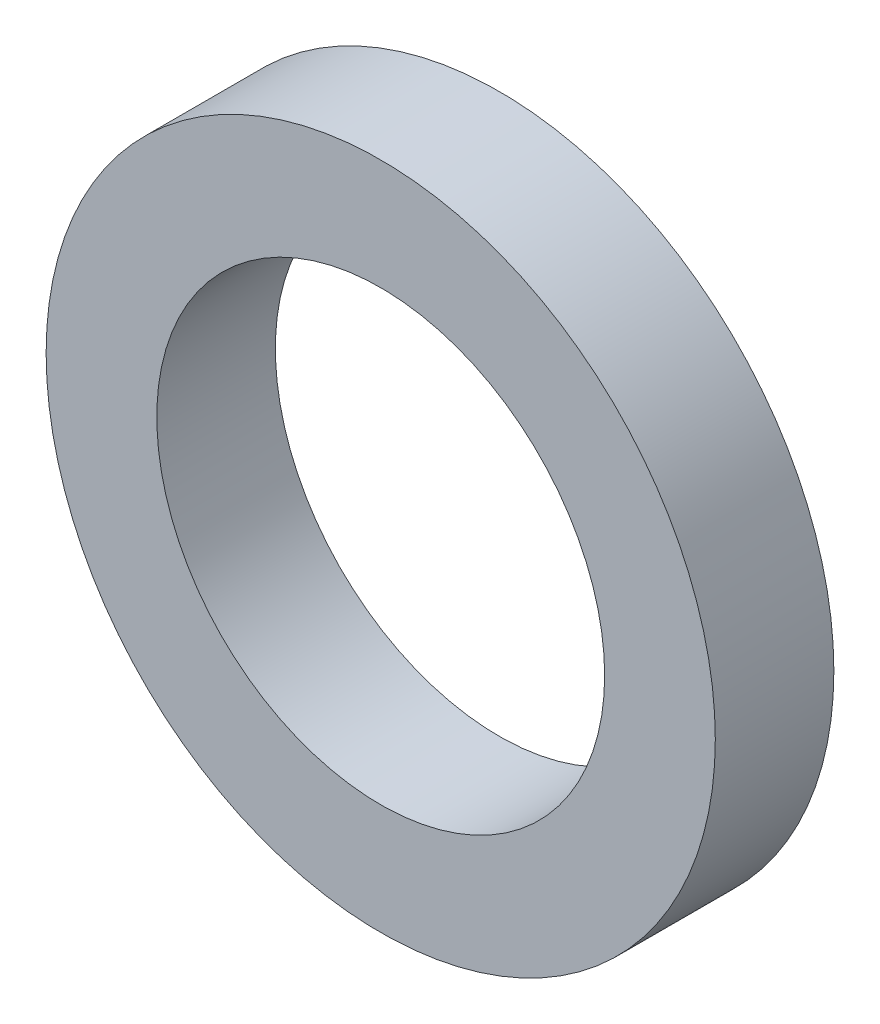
from build123d import *

# Parameters (mm, degrees)
SKETCH1_R           = 12.7
SKETCH1_R_2         = 8.5
BOSS_EXTRUDE1_DEPTH = 4.5


with BuildPart() as part:
    # Sketch1 → Boss-Extrude1 (new body)
    with BuildSketch(Plane.XY):
        Circle(SKETCH1_R)
        Circle(SKETCH1_R_2, mode=Mode.SUBTRACT)
    extrude(amount=BOSS_EXTRUDE1_DEPTH)


solid = part.part
